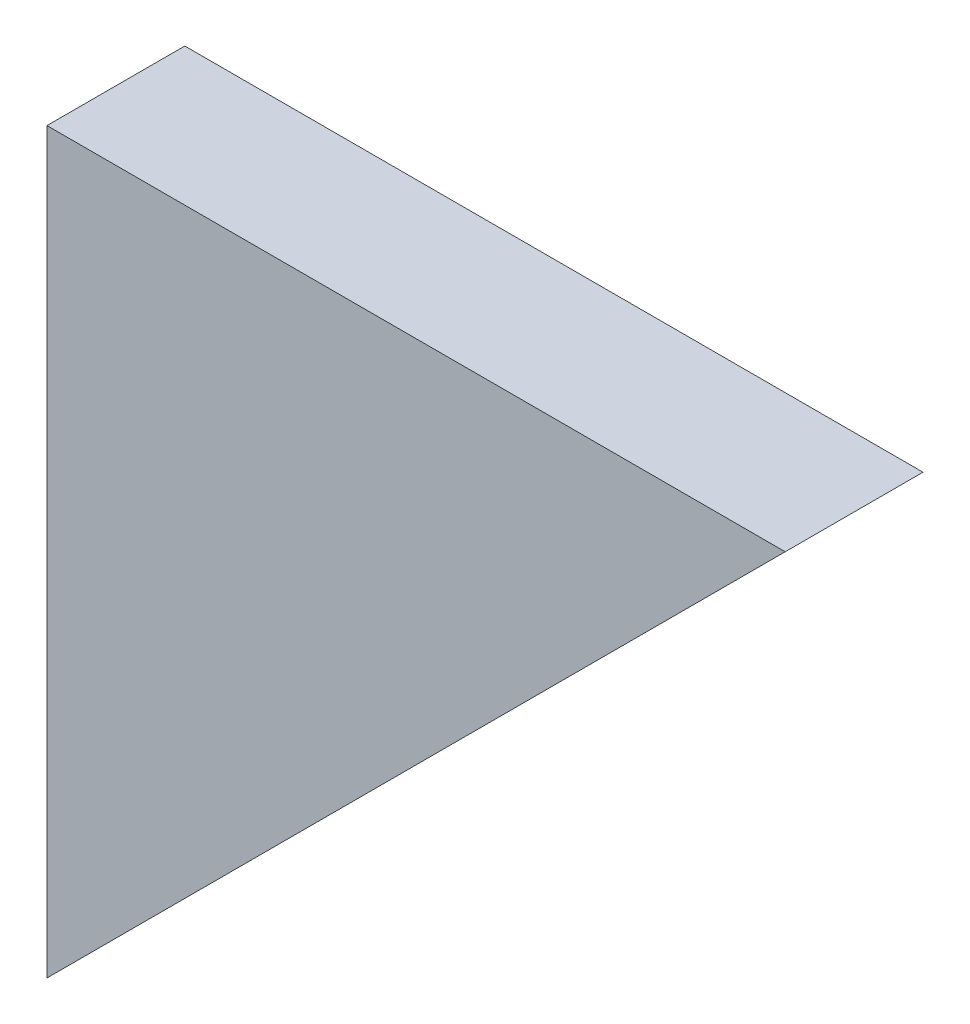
from build123d import *

# Parameters (mm, degrees)
ESTRUSIONE_ESTRUSIONE1_DEPTH = 5.6


with BuildPart() as part:
    # Schizzo1 → Estrusione-Estrusione1 (new body)
    with BuildSketch(Plane.XY):
        Polygon((-46.867718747, 14.605263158), (-46.867718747, -15.394736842), (-16.867718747, 14.605263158), align=None)
    extrude(amount=ESTRUSIONE_ESTRUSIONE1_DEPTH)


solid = part.part
